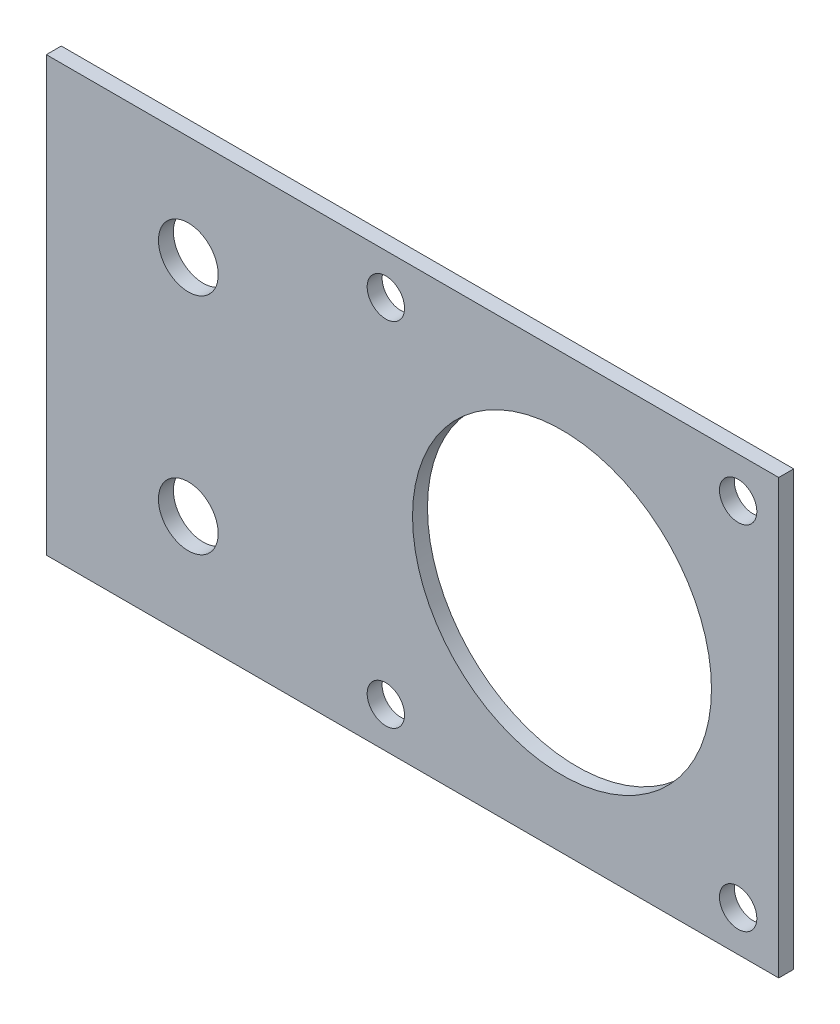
from build123d import *

# Parameters (mm, degrees)
CROQUIS1_W                    = 98
CROQUIS1_H                    = 58
CROQUIS1_R                    = 20
EXTRUIR1_DEPTH                = 2
DI_METRO_DE_TALADRO_5_0_5_1_D = 5
DI_METRO_DE_TALADRO_8_0_8_1_D = 8


with BuildPart() as part:
    # Croquis1 → Extruir1 (new body)
    with BuildSketch(Plane.XY):
        with Locations((-20, 0)):
            Rectangle(CROQUIS1_W, CROQUIS1_H)
        Circle(CROQUIS1_R, mode=Mode.SUBTRACT)
    extrude(amount=EXTRUIR1_DEPTH)

    # Di_metro de taladro _5.0 _5_1 (through all)
    with Locations(Plane.XY.offset(2)):
        with Locations((23.57, 23.57), (-23.57, 23.57), (23.57, -23.57), (-23.57, -23.57)):
            Hole(DI_METRO_DE_TALADRO_5_0_5_1_D / 2)

    # Di_metro de taladro _8.0 _8_1 (through all)
    with Locations(Plane(origin=(-50, 15, 2), x_dir=(1, 0, 0), z_dir=(0, 0, 1))):
        with Locations((0, 0), (0, -30)):
            Hole(DI_METRO_DE_TALADRO_8_0_8_1_D / 2)


solid = part.part
